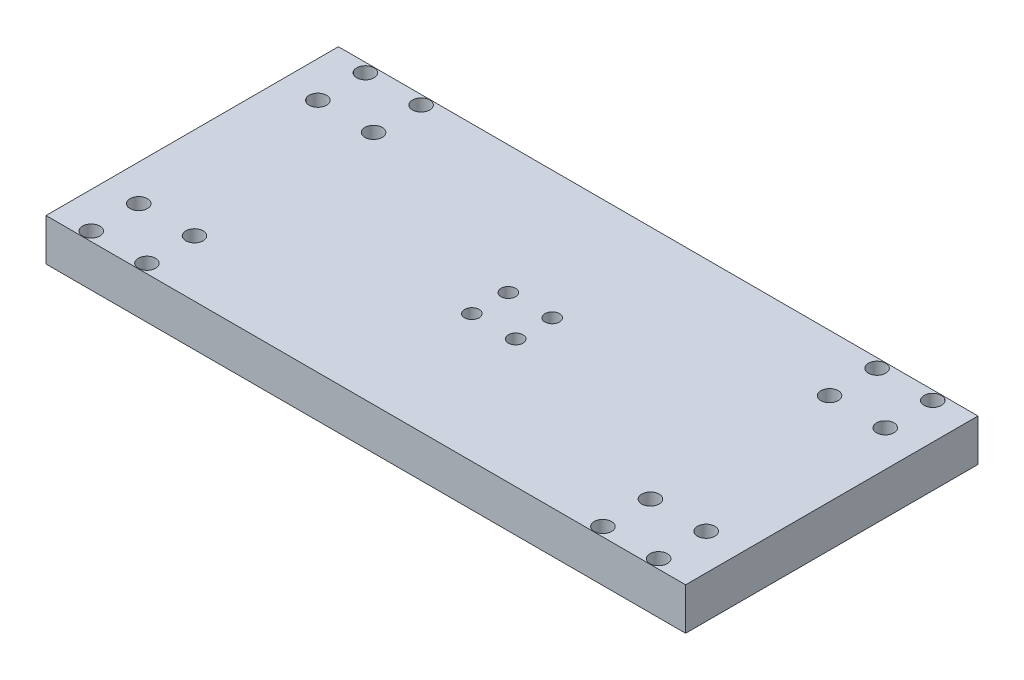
from build123d import *

# Parameters (mm, degrees)
CROQUIS1_W              = 350
CROQUIS1_H              = 160
CROQUIS1_R              = 4.75
SALIENTE_EXTRUIR1_DEPTH = 23
CROQUIS2_R              = 4
CORTAR_EXTRUIR1_DEPTH   = 10


with BuildPart() as part:
    # Croquis1 → Saliente-Extruir1 (new body)
    with BuildSketch(Plane(origin=(0, 0, 0), x_dir=(1, 0, 0), z_dir=(0, 1, 0))):
        with Locations((175, 80)):
            Rectangle(CROQUIS1_W, CROQUIS1_H)
        with Locations(Location((19.75, 155, 0), (0, 0, 270))):
            Circle(CROQUIS1_R, mode=Mode.SUBTRACT)
        with Locations(Location((50.25, 155, 0), (0, 0, 270))):
            Circle(CROQUIS1_R, mode=Mode.SUBTRACT)
        with Locations(Location((50.25, 129, 0), (0, 0, 270))):
            Circle(CROQUIS1_R, mode=Mode.SUBTRACT)
        with Locations(Location((19.75, 129, 0), (0, 0, 270))):
            Circle(CROQUIS1_R, mode=Mode.SUBTRACT)
        with Locations(Location((299.75, 155, 0), (0, 0, 270))):
            Circle(CROQUIS1_R, mode=Mode.SUBTRACT)
        with Locations(Location((330.25, 155, 0), (0, 0, 270))):
            Circle(CROQUIS1_R, mode=Mode.SUBTRACT)
        with Locations(Location((330.25, 129, 0), (0, 0, 270))):
            Circle(CROQUIS1_R, mode=Mode.SUBTRACT)
        with Locations(Location((299.75, 129, 0), (0, 0, 270))):
            Circle(CROQUIS1_R, mode=Mode.SUBTRACT)
        with Locations(Location((299.75, 31, 0), (0, 0, 90))):
            Circle(CROQUIS1_R, mode=Mode.SUBTRACT)
        with Locations(Location((330.25, 31, 0), (0, 0, 90))):
            Circle(CROQUIS1_R, mode=Mode.SUBTRACT)
        with Locations(Location((330.25, 5, 0), (0, 0, 90))):
            Circle(CROQUIS1_R, mode=Mode.SUBTRACT)
        with Locations(Location((299.75, 5, 0), (0, 0, 90))):
            Circle(CROQUIS1_R, mode=Mode.SUBTRACT)
        with Locations(Location((19.75, 31, 0), (0, 0, 90))):
            Circle(CROQUIS1_R, mode=Mode.SUBTRACT)
        with Locations(Location((50.25, 31, 0), (0, 0, 90))):
            Circle(CROQUIS1_R, mode=Mode.SUBTRACT)
        with Locations(Location((50.25, 5, 0), (0, 0, 90))):
            Circle(CROQUIS1_R, mode=Mode.SUBTRACT)
        with Locations(Location((19.75, 5, 0), (0, 0, 90))):
            Circle(CROQUIS1_R, mode=Mode.SUBTRACT)
    extrude(amount=SALIENTE_EXTRUIR1_DEPTH)

    # Croquis2 → Cortar-Extruir1 (cut)
    with BuildSketch(Plane(origin=(0, 23, 0), x_dir=(1, 0, 0), z_dir=(0, 1, 0))):
        with Locations(Location((163, 90, 0), (0, 0, 270))):
            Circle(CROQUIS2_R)
        with Locations(Location((187, 90, 0), (0, 0, 270))):
            Circle(CROQUIS2_R)
        with Locations(Location((163, 70, 0), (0, 0, 270))):
            Circle(CROQUIS2_R)
        with Locations(Location((187, 70, 0), (0, 0, 270))):
            Circle(CROQUIS2_R)
    extrude(amount=-CORTAR_EXTRUIR1_DEPTH, mode=Mode.SUBTRACT)


solid = part.part
